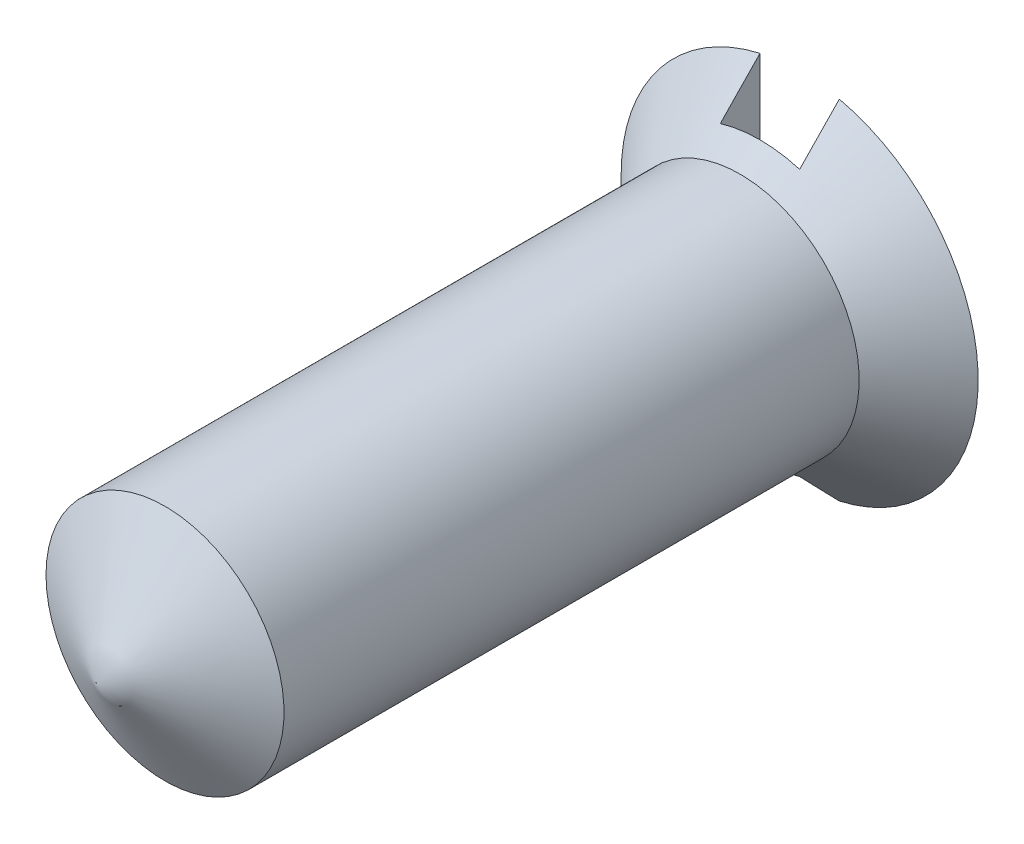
from build123d import *

# Parameters (mm, degrees)
SKETCH2_W          = 2
SKETCH2_H          = 10.452840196
CUT_EXTRUDE1_DEPTH = 1


with BuildPart() as part:
    # Sketch1 → Revolve1 (revolve)
    with BuildSketch(Plane(origin=(0, 0, 0), x_dir=(1, 0, 0), z_dir=(0, 1, 0)), mode=Mode.PRIVATE) as revolve1_sk:
        Polygon((0, 0), (0, 17.732050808), (4.5, 17.732050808), (3, 16.232050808), (3, 1.732050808), align=None)
    revolve(revolve1_sk.sketch.rotate(Axis((0, 0, 0), (0, 0, 1)), 180), axis=Axis((0, 0, 0), (0, 0, 1)))

    # Sketch2 → Cut-Extrude1 (cut)
    with BuildSketch(Plane(origin=(0, 0, -17.732050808), x_dir=(-1, 0, 0), z_dir=(0, 0, -1))):
        Rectangle(SKETCH2_W, SKETCH2_H)
    extrude(amount=-CUT_EXTRUDE1_DEPTH, mode=Mode.SUBTRACT)


solid = part.part
